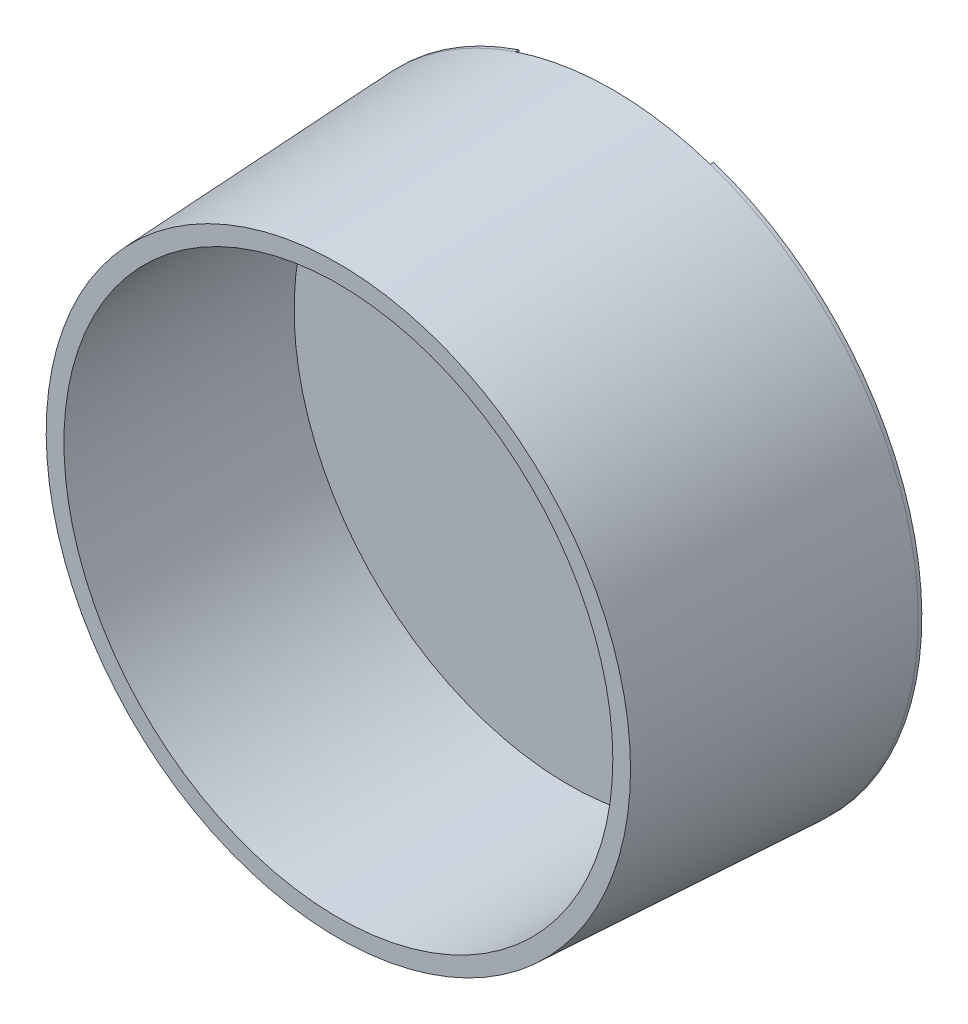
from build123d import *

# Parameters (mm, degrees)
ESQUISSE1_R             = 16.5
ESQUISSE2_R             = 17.25
ESQUISSE3_R             = 15.5
ENL_V_MAT_EXTRU_1_DEPTH = 13
ESQUISSE4_R             = 0.5
BOSS_EXTRU_1_DEPTH      = 1
BOSS_EXTRU_2_DEPTH      = 0.2
BOSS_EXTRU_3_DEPTH      = 0.2


with BuildPart() as part:
    # Esquisse1 → Lissage1 section 0
    with BuildSketch(Plane.XY):
        Circle(ESQUISSE1_R)
    # Esquisse2 → Lissage1 section 1
    with BuildSketch(Plane.XY.offset(-15.5)):
        Circle(ESQUISSE2_R)
    loft()

    # Esquisse3 → Enl_v. mat.-Extru.1 (cut)
    with BuildSketch(Plane.XY):
        Circle(ESQUISSE3_R)
    extrude(amount=-ENL_V_MAT_EXTRU_1_DEPTH, mode=Mode.SUBTRACT)

    # Esquisse4 → Boss.-Extru.1 (add)
    with BuildSketch(Plane.XY.offset(-15.5)):
        with Locations((0, 13.25)):
            Circle(ESQUISSE4_R)
    extrude(amount=-BOSS_EXTRU_1_DEPTH)

    # Esquisse5 → Boss.-Extru.2 (add)
    with BuildSketch(Plane(origin=(0, 0, -15.5), x_dir=(-1, 0, 0), z_dir=(0, 0, -1))):
        with BuildLine():
            Line((-5.5, 16.349694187), (-5.5, 13.145816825))
            ThreePointArc((-5.5, 13.145816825), (0, -14.25), (5.5, 13.145816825))
            Line((5.5, 13.145816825), (5.5, 16.349694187))
            ThreePointArc((5.5, 16.349694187), (0, -17.25), (-5.5, 16.349694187))
        make_face()
    extrude(amount=BOSS_EXTRU_2_DEPTH)

    # Esquisse6 → Boss.-Extru.3 (add)
    # profile 1 of 3: a face of its own
    with BuildSketch(Plane(origin=(0, 0, -15.5), x_dir=(-1, 0, 0), z_dir=(0, 0, -1))):
        with BuildLine():
            add(Edge.make_bspline(
                [(-2.919961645, -1.517144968), (-3.020833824, -1.517282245), (-3.225025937, -1.517560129), (-3.42916736, -1.522126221), (-3.532461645, -1.524436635)],
                knots=[0, 0, 0, 0, 0.988012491, 2, 2, 2, 2], degree=3))
            Line((-3.532461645, -1.524436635), (-3.541940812, -1.431103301))
            Line((-3.541940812, -1.431103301), (-3.239336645, -1.337769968))
            add(Edge.make_bspline(
                [(-3.239336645, -1.337769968), (-3.229595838, -1.334169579), (-3.211558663, -1.327502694), (-3.189495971, -1.310056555), (-3.176137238, -1.286457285), (-3.174064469, -1.268909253), (-3.172982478, -1.259749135)],
                knots=[0, 0, 0, 0, 1.127610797, 2.088011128, 3.001936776, 4, 4, 4, 4], degree=3))
            add(Edge.make_bspline(
                [(-3.172982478, -1.259749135), (-3.172176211, -1.224264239), (-3.17047544, -1.149411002), (-3.169411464, -1.030790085), (-3.167431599, -0.899546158), (-3.167724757, -0.807666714), (-3.167878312, -0.759540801)],
                knots=[0, 0, 0, 0, 0.851424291, 1.796027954, 2.845572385, 4, 4, 4, 4], degree=3))
            Line((-3.167878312, -0.759540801), (-3.167878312, 1.280667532))
            add(Edge.make_bspline(
                [(-3.167878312, 1.280667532), (-3.167721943, 1.321258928), (-3.167425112, 1.398312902), (-3.16941221, 1.508166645), (-3.17046952, 1.606859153), (-3.172175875, 1.669071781), (-3.172982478, 1.698480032)],
                knots=[0, 0, 0, 0, 1.165661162, 2.212755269, 3.155159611, 4, 4, 4, 4], degree=3))
            add(Edge.make_bspline(
                [(-3.172982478, 1.698480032), (-3.173768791, 1.708614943), (-3.175251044, 1.727719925), (-3.187889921, 1.753003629), (-3.206543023, 1.773340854), (-3.223396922, 1.780248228), (-3.232044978, 1.783792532)],
                knots=[0, 0, 0, 0, 1.089053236, 2.052937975, 3.000925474, 4, 4, 4, 4], degree=3))
            Line((-3.232044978, 1.783792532), (-3.536836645, 1.882230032))
            Line((-3.536836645, 1.882230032), (-3.541940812, 1.975563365))
            add(Edge.make_bspline(
                [(-3.541940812, 1.975563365), (-3.437433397, 1.972706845), (-3.230873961, 1.967060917), (-3.024238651, 1.966407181), (-2.922149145, 1.966084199)],
                knots=[0, 0, 0, 0, 1.011887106, 2, 2, 2, 2], degree=3))
            add(Edge.make_bspline(
                [(-2.922149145, 1.966084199), (-2.84096769, 1.966460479), (-2.681516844, 1.967199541), (-2.444051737, 1.97019344), (-2.207824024, 1.974755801), (-2.049825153, 1.975291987), (-1.969857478, 1.975563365)],
                knots=[0, 0, 0, 0, 1.022929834, 2.009166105, 2.992382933, 4, 4, 4, 4], degree=3))
            add(Edge.make_bspline(
                [(-1.969857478, 1.975563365), (-1.899564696, 1.974661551), (-1.763321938, 1.972913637), (-1.566018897, 1.953284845), (-1.382122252, 1.923283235), (-1.211299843, 1.880687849), (-1.054167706, 1.824413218), (-0.910035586, 1.75683344), (-0.779903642, 1.676014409), (-0.662968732, 1.58317179), (-0.560338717, 1.477144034), (-0.470710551, 1.359846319), (-0.395025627, 1.230306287), (-0.333902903, 1.088359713), (-0.285757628, 0.934669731), (-0.251951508, 0.769035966), (-0.231164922, 0.591651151), (-0.228996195, 0.469407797), (-0.227878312, 0.406396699)],
                knots=[0, 0, 0, 0, 1.256115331, 2.434625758, 3.540321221, 4.584600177, 5.576822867, 6.519394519, 7.424825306, 8.308959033, 9.181552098, 10.055744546, 10.941744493, 11.856261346, 12.812660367, 13.815583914, 14.874029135, 16, 16, 16, 16], degree=3))
            add(Edge.make_bspline(
                [(-0.227878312, 0.406396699), (-0.229060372, 0.331953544), (-0.23136121, 0.187052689), (-0.255461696, -0.023572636), (-0.293020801, -0.221397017), (-0.345069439, -0.407064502), (-0.413715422, -0.579499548), (-0.497263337, -0.739286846), (-0.596298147, -0.886043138), (-0.710105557, -1.019768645), (-0.837934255, -1.138814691), (-0.978439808, -1.242370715), (-1.130771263, -1.330585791), (-1.296314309, -1.401161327), (-1.473485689, -1.456423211), (-1.66257814, -1.496682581), (-1.864033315, -1.519883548), (-2.0023666, -1.522891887), (-2.073399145, -1.524436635)],
                knots=[0, 0, 0, 0, 1.176677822, 2.290359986, 3.347120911, 4.358084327, 5.334403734, 6.276482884, 7.203865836, 8.128057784, 9.0471934, 9.959619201, 10.882523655, 11.824202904, 12.799068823, 13.812921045, 14.876960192, 16, 16, 16, 16], degree=3))
            add(Edge.make_bspline(
                [(-2.073399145, -1.524436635), (-2.112531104, -1.524485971), (-2.188608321, -1.524581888), (-2.29944565, -1.523906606), (-2.403711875, -1.522253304), (-2.537149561, -1.520364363), (-2.708490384, -1.517167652), (-2.84728592, -1.517152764), (-2.919961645, -1.517144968)],
                knots=[0, 0, 0, 0, 0.831995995, 1.617499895, 2.356549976, 3.049095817, 4.45485594, 6, 6, 6, 6], degree=3))
        make_face()
        with BuildLine():
            add(Edge.make_bspline(
                [(-2.701211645, -1.259749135), (-2.652888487, -1.265561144), (-2.557395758, -1.277046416), (-2.414515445, -1.286034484), (-2.272976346, -1.290185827), (-2.178888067, -1.290796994), (-2.131732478, -1.291103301)],
                knots=[0, 0, 0, 0, 1.023124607, 2.021824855, 3.008569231, 4, 4, 4, 4], degree=3))
            add(Edge.make_bspline(
                [(-2.131732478, -1.291103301), (-2.078457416, -1.290031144), (-1.975005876, -1.287949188), (-1.824821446, -1.270514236), (-1.684523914, -1.240424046), (-1.553756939, -1.199458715), (-1.432863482, -1.145522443), (-1.321478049, -1.08072855), (-1.219846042, -1.003598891), (-1.128782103, -0.913845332), (-1.048178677, -0.811597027), (-0.977886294, -0.697121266), (-0.918797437, -0.570056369), (-0.870900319, -0.430396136), (-0.833118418, -0.278408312), (-0.806635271, -0.11377975), (-0.790376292, 0.063358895), (-0.788729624, 0.185665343), (-0.787878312, 0.248896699)],
                knots=[0, 0, 0, 0, 1.092360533, 2.121187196, 3.094938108, 4.031331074, 4.926136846, 5.804124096, 6.668478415, 7.535573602, 8.419146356, 9.332189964, 10.284370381, 11.286961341, 12.355671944, 13.492275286, 14.70352841, 16, 16, 16, 16], degree=3))
            add(Edge.make_bspline(
                [(-0.787878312, 0.248896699), (-0.788784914, 0.310181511), (-0.790540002, 0.428822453), (-0.806089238, 0.600808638), (-0.831007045, 0.760539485), (-0.866646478, 0.908194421), (-0.912528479, 1.043400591), (-0.967579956, 1.167142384), (-1.034321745, 1.277979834), (-1.111492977, 1.376878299), (-1.199790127, 1.463921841), (-1.300276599, 1.538871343), (-1.412159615, 1.60241434), (-1.536491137, 1.653661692), (-1.6722733, 1.693115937), (-1.81978889, 1.722572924), (-1.979211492, 1.738873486), (-2.089404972, 1.741086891), (-2.146315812, 1.742230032)],
                knots=[0, 0, 0, 0, 1.26379779, 2.446579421, 3.558388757, 4.595538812, 5.575270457, 6.499647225, 7.383467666, 8.236894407, 9.08059209, 9.932825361, 10.815165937, 11.727556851, 12.699911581, 13.727311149, 14.826240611, 16, 16, 16, 16], degree=3))
            add(Edge.make_bspline(
                [(-2.146315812, 1.742230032), (-2.185692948, 1.741868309), (-2.268350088, 1.741109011), (-2.399136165, 1.737304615), (-2.544763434, 1.730781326), (-2.64702224, 1.723966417), (-2.701211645, 1.720355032)],
                knots=[0, 0, 0, 0, 0.850764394, 1.785852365, 2.826669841, 4, 4, 4, 4], degree=3))
            Line((-2.701211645, 1.720355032), (-2.701211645, -1.259749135))
        make_face(mode=Mode.SUBTRACT)
    # profile 2 of 3: a face of its own
    with BuildSketch(Plane(origin=(0, 0, -15.5), x_dir=(-1, 0, 0), z_dir=(0, 0, -1))):
        with BuildLine():
            add(Edge.make_bspline(
                [(0.191392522, 1.975563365), (0.294684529, 1.972706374), (0.495897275, 1.967140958), (0.697185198, 1.966430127), (0.795142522, 1.966084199)],
                knots=[0, 0, 0, 0, 1.026694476, 2, 2, 2, 2], degree=3))
            add(Edge.make_bspline(
                [(0.795142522, 1.966084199), (0.893099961, 1.966424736), (1.093659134, 1.967121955), (1.294142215, 1.972706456), (1.396705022, 1.975563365)],
                knots=[0, 0, 0, 0, 0.976843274, 2, 2, 2, 2], degree=3))
            Line((1.396705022, 1.975563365), (1.409100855, 1.882230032))
            Line((1.409100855, 1.882230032), (1.103580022, 1.790355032))
            add(Edge.make_bspline(
                [(1.103580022, 1.790355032), (1.094284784, 1.78756499), (1.076475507, 1.78221939), (1.055309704, 1.764543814), (1.040800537, 1.740994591), (1.038467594, 1.722765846), (1.037225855, 1.713063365)],
                knots=[0, 0, 0, 0, 1.050780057, 2.013249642, 2.942527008, 4, 4, 4, 4], degree=3))
            add(Edge.make_bspline(
                [(1.037225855, 1.713063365), (1.036439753, 1.682682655), (1.034798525, 1.619253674), (1.033396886, 1.520081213), (1.032859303, 1.412160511), (1.032374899, 1.337299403), (1.032121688, 1.298167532)],
                knots=[0, 0, 0, 0, 0.878899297, 1.834969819, 2.868281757, 4, 4, 4, 4], degree=3))
            Line((1.032121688, 1.298167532), (1.032121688, -0.953499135))
            add(Edge.make_bspline(
                [(1.032121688, -0.953499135), (1.031712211, -0.993117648), (1.030910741, -1.070662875), (1.028447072, -1.184222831), (1.022426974, -1.292405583), (1.014352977, -1.394986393), (1.004934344, -1.492466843), (0.989798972, -1.58428469), (0.972891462, -1.671090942), (0.951340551, -1.752537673), (0.927251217, -1.829472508), (0.896499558, -1.901450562), (0.862903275, -1.969833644), (0.823668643, -2.033854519), (0.779933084, -2.094425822), (0.729000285, -2.150224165), (0.673676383, -2.203878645), (0.612095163, -2.253529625), (0.54409839, -2.299692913), (0.46988633, -2.343701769), (0.387536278, -2.383349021), (0.298636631, -2.421484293), (0.201320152, -2.456432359), (0.095899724, -2.489619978), (-0.018105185, -2.521902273), (-0.097289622, -2.541157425), (-0.138190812, -2.551103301)],
                knots=[0, 0, 0, 0, 1.277177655, 2.49981691, 3.661068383, 4.769139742, 5.816932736, 6.816483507, 7.767604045, 8.666463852, 9.53117785, 10.363481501, 11.186887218, 11.985043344, 12.781120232, 13.591185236, 14.416824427, 15.263569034, 16.137181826, 17.064346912, 18.041947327, 19.081004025, 20.181459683, 21.373310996, 22.643234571, 24, 24, 24, 24], degree=3))
            Line((-0.138190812, -2.551103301), (-0.175378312, -2.427144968))
            add(Edge.make_bspline(
                [(-0.175378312, -2.427144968), (-0.134761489, -2.408987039), (-0.056695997, -2.374087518), (0.051063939, -2.315130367), (0.145686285, -2.253842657), (0.226858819, -2.188578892), (0.296086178, -2.118636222), (0.357340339, -2.046240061), (0.407628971, -1.96778602), (0.450675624, -1.885499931), (0.484502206, -1.797718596), (0.511626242, -1.705003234), (0.531958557, -1.607208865), (0.545324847, -1.503550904), (0.554429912, -1.394029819), (0.561007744, -1.278047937), (0.564470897, -1.155256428), (0.565120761, -1.071139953), (0.565455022, -1.027874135)],
                knots=[0, 0, 0, 0, 1.242146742, 2.387404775, 3.426670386, 4.387155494, 5.289537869, 6.171702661, 7.030255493, 7.886416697, 8.761238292, 9.65265209, 10.58190204, 11.547673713, 12.569704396, 13.650738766, 14.791643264, 16, 16, 16, 16], degree=3))
            Line((0.565455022, -1.027874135), (0.565455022, 1.287959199))
            add(Edge.make_bspline(
                [(0.565455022, 1.287959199), (0.565613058, 1.328307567), (0.565912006, 1.404632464), (0.563922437, 1.513270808), (0.562865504, 1.610505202), (0.5611575, 1.671745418), (0.560350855, 1.700667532)],
                knots=[0, 0, 0, 0, 1.173007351, 2.21891662, 3.158842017, 4, 4, 4, 4], degree=3))
            add(Edge.make_bspline(
                [(0.560350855, 1.700667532), (0.559549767, 1.710788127), (0.558039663, 1.729866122), (0.545668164, 1.755174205), (0.526508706, 1.774753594), (0.509895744, 1.781668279), (0.501288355, 1.785250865)],
                knots=[0, 0, 0, 0, 1.094186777, 2.062615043, 2.996216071, 4, 4, 4, 4], degree=3))
            Line((0.501288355, 1.785250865), (0.196496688, 1.882230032))
            Line((0.196496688, 1.882230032), (0.191392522, 1.975563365))
        make_face()
    # profile 3 of 3: a face of its own
    with BuildSketch(Plane(origin=(0, 0, -15.5), x_dir=(-1, 0, 0), z_dir=(0, 0, -1))):
        with BuildLine():
            add(Edge.make_bspline(
                [(2.665455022, -0.759540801), (2.665708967, -0.807422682), (2.666193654, -0.898811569), (2.666715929, -1.02933585), (2.668116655, -1.147466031), (2.669771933, -1.222076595), (2.670559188, -1.257561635)],
                knots=[0, 0, 0, 0, 1.153666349, 2.201924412, 3.144829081, 4, 4, 4, 4], degree=3))
            add(Edge.make_bspline(
                [(2.670559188, -1.257561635), (2.671952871, -1.267563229), (2.674666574, -1.287037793), (2.693060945, -1.312566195), (2.721281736, -1.331441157), (2.744188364, -1.338856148), (2.756600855, -1.342874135)],
                knots=[0, 0, 0, 0, 0.918546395, 1.788543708, 2.801670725, 4, 4, 4, 4], degree=3))
            Line((2.756600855, -1.342874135), (3.035142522, -1.431103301))
            Line((3.035142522, -1.431103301), (3.039517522, -1.524436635))
            add(Edge.make_bspline(
                [(3.039517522, -1.524436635), (2.936466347, -1.522124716), (2.73572717, -1.517621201), (2.534938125, -1.517300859), (2.437225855, -1.517144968)],
                knots=[0, 0, 0, 0, 1.02671712, 2, 2, 2, 2], degree=3))
            add(Edge.make_bspline(
                [(2.437225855, -1.517144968), (2.338541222, -1.517290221), (2.137508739, -1.517586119), (1.936527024, -1.522125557), (1.834205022, -1.524436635)],
                knots=[0, 0, 0, 0, 0.98177799, 2, 2, 2, 2], degree=3))
            Line((1.834205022, -1.524436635), (1.824725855, -1.431103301))
            Line((1.824725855, -1.431103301), (2.127330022, -1.337769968))
            add(Edge.make_bspline(
                [(2.127330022, -1.337769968), (2.136585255, -1.334392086), (2.154159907, -1.327977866), (2.175634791, -1.310577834), (2.189962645, -1.287137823), (2.192401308, -1.269190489), (2.193684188, -1.259749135)],
                knots=[0, 0, 0, 0, 1.072356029, 2.036284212, 2.966969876, 4, 4, 4, 4], degree=3))
            add(Edge.make_bspline(
                [(2.193684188, -1.259749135), (2.194490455, -1.224264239), (2.196191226, -1.149411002), (2.197255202, -1.030790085), (2.199235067, -0.899546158), (2.198941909, -0.807666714), (2.198788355, -0.759540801)],
                knots=[0, 0, 0, 0, 0.851424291, 1.796027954, 2.845572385, 4, 4, 4, 4], degree=3))
            Line((2.198788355, -0.759540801), (2.198788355, 1.280667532))
            add(Edge.make_bspline(
                [(2.198788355, 1.280667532), (2.198944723, 1.321258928), (2.199241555, 1.398312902), (2.197254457, 1.508166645), (2.196197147, 1.606859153), (2.194490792, 1.669071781), (2.193684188, 1.698480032)],
                knots=[0, 0, 0, 0, 1.165661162, 2.212755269, 3.155159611, 4, 4, 4, 4], degree=3))
            add(Edge.make_bspline(
                [(2.193684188, 1.698480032), (2.192897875, 1.708614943), (2.191415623, 1.727719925), (2.178776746, 1.753003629), (2.160123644, 1.773340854), (2.143269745, 1.780248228), (2.134621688, 1.783792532)],
                knots=[0, 0, 0, 0, 1.089053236, 2.052937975, 3.000925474, 4, 4, 4, 4], degree=3))
            Line((2.134621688, 1.783792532), (1.829830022, 1.882230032))
            Line((1.829830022, 1.882230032), (1.824725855, 1.975563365))
            add(Edge.make_bspline(
                [(1.824725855, 1.975563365), (1.927774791, 1.972706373), (2.128501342, 1.967141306), (2.329303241, 1.966430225), (2.427017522, 1.966084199)],
                knots=[0, 0, 0, 0, 1.026759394, 2, 2, 2, 2], degree=3))
            add(Edge.make_bspline(
                [(2.427017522, 1.966084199), (2.525218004, 1.96642465), (2.7262632, 1.967121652), (2.927232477, 1.972706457), (3.030038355, 1.975563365)],
                knots=[0, 0, 0, 0, 0.976899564, 2, 2, 2, 2], degree=3))
            Line((3.030038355, 1.975563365), (3.039517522, 1.882230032))
            Line((3.039517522, 1.882230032), (2.734725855, 1.788896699))
            add(Edge.make_bspline(
                [(2.734725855, 1.788896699), (2.725614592, 1.786164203), (2.708315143, 1.780976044), (2.688376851, 1.762459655), (2.674256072, 1.738995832), (2.671833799, 1.720571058), (2.670559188, 1.710875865)],
                knots=[0, 0, 0, 0, 1.036961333, 1.968866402, 2.93120901, 4, 4, 4, 4], degree=3))
            add(Edge.make_bspline(
                [(2.670559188, 1.710875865), (2.669772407, 1.680252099), (2.668124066, 1.616093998), (2.666732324, 1.515706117), (2.666192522, 1.406327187), (2.6657081, 1.330493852), (2.665455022, 1.290875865)],
                knots=[0, 0, 0, 0, 0.875161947, 1.833501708, 2.868145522, 4, 4, 4, 4], degree=3))
            Line((2.665455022, 1.290875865), (2.665455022, -0.759540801))
        make_face()
    extrude(amount=BOSS_EXTRU_3_DEPTH)


solid = part.part
